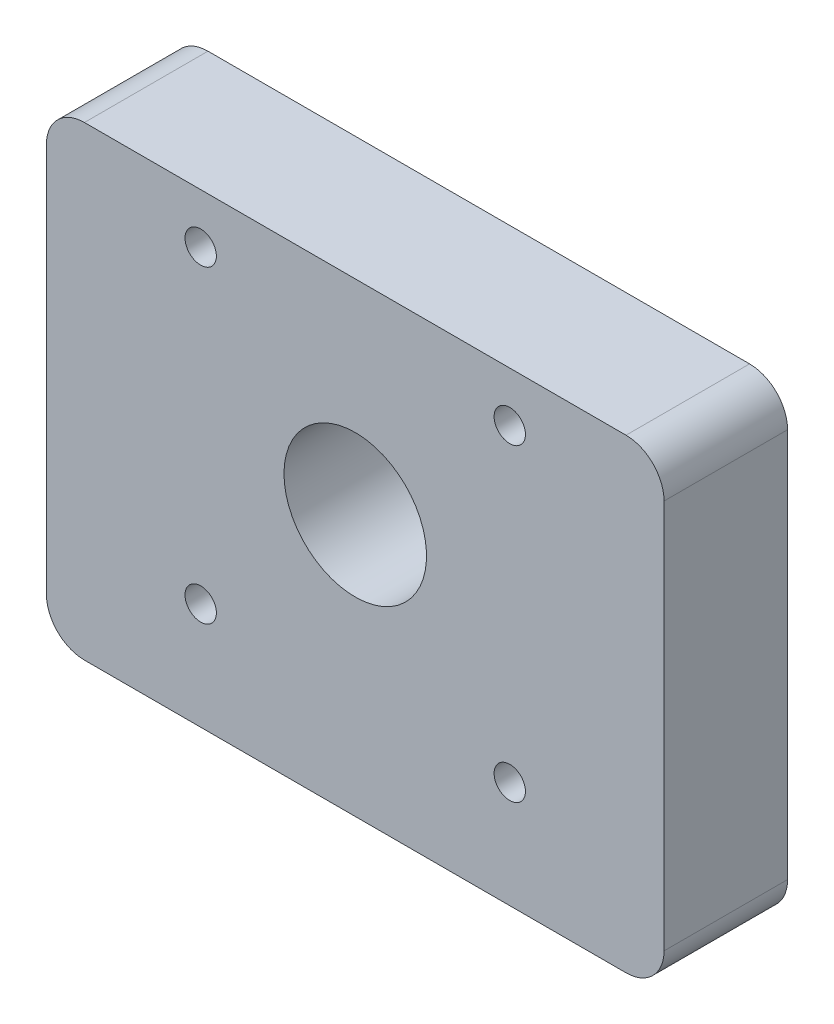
ISO-10303-21;
HEADER;
FILE_DESCRIPTION(('STEP AP214'),'2;1');
FILE_NAME('part.step','',(''),(''),'','','');
FILE_SCHEMA(('AUTOMOTIVE_DESIGN { 1 0 10303 214 1 1 1 1 }'));
ENDSEC;
DATA;
#1=APPLICATION_CONTEXT('core data for automotive mechanical design processes');
#2=APPLICATION_PROTOCOL_DEFINITION('international standard','automotive_design',2000,#1);
#3=PRODUCT_CONTEXT('',#1,'mechanical');
#4=PRODUCT('Part','Part','',(#3));
#5=PRODUCT_RELATED_PRODUCT_CATEGORY('part','',(#4));
#6=PRODUCT_DEFINITION_FORMATION('','',#4);
#7=PRODUCT_DEFINITION_CONTEXT('part definition',#1,'design');
#8=PRODUCT_DEFINITION('design','',#6,#7);
#9=PRODUCT_DEFINITION_SHAPE('','',#8);
#10=(LENGTH_UNIT() NAMED_UNIT(*) SI_UNIT(.MILLI.,.METRE.));
#11=(NAMED_UNIT(*) PLANE_ANGLE_UNIT() SI_UNIT($,.RADIAN.));
#12=(NAMED_UNIT(*) SI_UNIT($,.STERADIAN.) SOLID_ANGLE_UNIT());
#13=UNCERTAINTY_MEASURE_WITH_UNIT(LENGTH_MEASURE(1.E-05),#10,'distance_accuracy_value','');
#14=(GEOMETRIC_REPRESENTATION_CONTEXT(3) GLOBAL_UNCERTAINTY_ASSIGNED_CONTEXT((#13)) GLOBAL_UNIT_ASSIGNED_CONTEXT((#10,
#11,#12)) REPRESENTATION_CONTEXT('',''));
#15=CARTESIAN_POINT('',(0.,0.,0.));
#16=DIRECTION('',(0.,0.,1.));
#17=DIRECTION('',(1.,0.,0.));
#18=AXIS2_PLACEMENT_3D('',#15,#16,#17);
#19=CARTESIAN_POINT('',(32.5,-27.5,13.));
#20=DIRECTION('',(-1.,0.,0.));
#21=DIRECTION('',(0.,0.,1.));
#22=AXIS2_PLACEMENT_3D('',#19,#20,#21);
#23=PLANE('',#22);
#24=DIRECTION('',(0.,1.,0.));
#25=VECTOR('',#24,1.);
#26=CARTESIAN_POINT('',(32.5,-27.5,0.));
#27=LINE('',#26,#25);
#28=CARTESIAN_POINT('',(32.5,-23.5,0.));
#29=VERTEX_POINT('',#28);
#30=CARTESIAN_POINT('',(32.5,17.5,0.));
#31=VERTEX_POINT('',#30);
#32=EDGE_CURVE('E150',#29,#31,#27,.T.);
#33=ORIENTED_EDGE('',*,*,#32,.T.);
#34=DIRECTION('',(0.,0.,-1.));
#35=VECTOR('',#34,1.);
#36=CARTESIAN_POINT('',(32.5,17.5,13.));
#37=LINE('',#36,#35);
#38=CARTESIAN_POINT('',(32.5,17.5,13.));
#39=VERTEX_POINT('',#38);
#40=EDGE_CURVE('E199',#31,#39,#37,.F.);
#41=ORIENTED_EDGE('',*,*,#40,.T.);
#42=DIRECTION('',(0.,1.,0.));
#43=VECTOR('',#42,1.);
#44=CARTESIAN_POINT('',(32.5,-27.5,13.));
#45=LINE('',#44,#43);
#46=CARTESIAN_POINT('',(32.5,-23.5,13.));
#47=VERTEX_POINT('',#46);
#48=EDGE_CURVE('E151',#47,#39,#45,.T.);
#49=ORIENTED_EDGE('',*,*,#48,.F.);
#50=DIRECTION('',(0.,0.,-1.));
#51=VECTOR('',#50,1.);
#52=CARTESIAN_POINT('',(32.5,-23.5,13.));
#53=LINE('',#52,#51);
#54=EDGE_CURVE('E196',#47,#29,#53,.T.);
#55=ORIENTED_EDGE('',*,*,#54,.T.);
#56=EDGE_LOOP('',(#33,#41,#49,#55));
#57=FACE_BOUND('',#56,.T.);
#58=ADVANCED_FACE('F36',(#57),#23,.F.);
#59=CARTESIAN_POINT('',(-32.5,21.5,13.));
#60=DIRECTION('',(0.,-1.,0.));
#61=DIRECTION('',(0.,0.,-1.));
#62=AXIS2_PLACEMENT_3D('',#59,#60,#61);
#63=PLANE('',#62);
#64=DIRECTION('',(-1.,0.,0.));
#65=VECTOR('',#64,1.);
#66=CARTESIAN_POINT('',(-32.5,21.5,0.));
#67=LINE('',#66,#65);
#68=CARTESIAN_POINT('',(28.5,21.5,0.));
#69=VERTEX_POINT('',#68);
#70=CARTESIAN_POINT('',(-28.5,21.5,0.));
#71=VERTEX_POINT('',#70);
#72=EDGE_CURVE('E165',#69,#71,#67,.T.);
#73=ORIENTED_EDGE('',*,*,#72,.T.);
#74=DIRECTION('',(0.,0.,-1.));
#75=VECTOR('',#74,1.);
#76=CARTESIAN_POINT('',(-28.5,21.5,13.));
#77=LINE('',#76,#75);
#78=CARTESIAN_POINT('',(-28.5,21.5,13.));
#79=VERTEX_POINT('',#78);
#80=EDGE_CURVE('E187',#71,#79,#77,.F.);
#81=ORIENTED_EDGE('',*,*,#80,.T.);
#82=DIRECTION('',(-1.,0.,0.));
#83=VECTOR('',#82,1.);
#84=CARTESIAN_POINT('',(-32.5,21.5,13.));
#85=LINE('',#84,#83);
#86=CARTESIAN_POINT('',(28.5,21.5,13.));
#87=VERTEX_POINT('',#86);
#88=EDGE_CURVE('E154',#87,#79,#85,.T.);
#89=ORIENTED_EDGE('',*,*,#88,.F.);
#90=DIRECTION('',(0.,0.,-1.));
#91=VECTOR('',#90,1.);
#92=CARTESIAN_POINT('',(28.5,21.5,13.));
#93=LINE('',#92,#91);
#94=EDGE_CURVE('E184',#87,#69,#93,.T.);
#95=ORIENTED_EDGE('',*,*,#94,.T.);
#96=EDGE_LOOP('',(#73,#81,#89,#95));
#97=FACE_BOUND('',#96,.T.);
#98=ADVANCED_FACE('F224',(#97),#63,.F.);
#99=CARTESIAN_POINT('',(-32.5,-27.5,13.));
#100=DIRECTION('',(1.,0.,0.));
#101=DIRECTION('',(0.,0.,-1.));
#102=AXIS2_PLACEMENT_3D('',#99,#100,#101);
#103=PLANE('',#102);
#104=DIRECTION('',(0.,-1.,0.));
#105=VECTOR('',#104,1.);
#106=CARTESIAN_POINT('',(-32.5,-27.5,13.));
#107=LINE('',#106,#105);
#108=CARTESIAN_POINT('',(-32.5,17.5,13.));
#109=VERTEX_POINT('',#108);
#110=CARTESIAN_POINT('',(-32.5,-23.5,13.));
#111=VERTEX_POINT('',#110);
#112=EDGE_CURVE('E158',#109,#111,#107,.T.);
#113=ORIENTED_EDGE('',*,*,#112,.F.);
#114=DIRECTION('',(0.,0.,-1.));
#115=VECTOR('',#114,1.);
#116=CARTESIAN_POINT('',(-32.5,17.5,13.));
#117=LINE('',#116,#115);
#118=CARTESIAN_POINT('',(-32.5,17.5,0.));
#119=VERTEX_POINT('',#118);
#120=EDGE_CURVE('E173',#109,#119,#117,.T.);
#121=ORIENTED_EDGE('',*,*,#120,.T.);
#122=DIRECTION('',(0.,-1.,0.));
#123=VECTOR('',#122,1.);
#124=CARTESIAN_POINT('',(-32.5,-27.5,0.));
#125=LINE('',#124,#123);
#126=CARTESIAN_POINT('',(-32.5,-23.5,0.));
#127=VERTEX_POINT('',#126);
#128=EDGE_CURVE('E168',#119,#127,#125,.T.);
#129=ORIENTED_EDGE('',*,*,#128,.T.);
#130=DIRECTION('',(0.,0.,-1.));
#131=VECTOR('',#130,1.);
#132=CARTESIAN_POINT('',(-32.5,-23.5,13.));
#133=LINE('',#132,#131);
#134=EDGE_CURVE('E162',#127,#111,#133,.F.);
#135=ORIENTED_EDGE('',*,*,#134,.T.);
#136=EDGE_LOOP('',(#113,#121,#129,#135));
#137=FACE_BOUND('',#136,.T.);
#138=ADVANCED_FACE('F232',(#137),#103,.F.);
#139=CARTESIAN_POINT('',(-32.5,-27.5,13.));
#140=DIRECTION('',(0.,1.,0.));
#141=DIRECTION('',(0.,0.,1.));
#142=AXIS2_PLACEMENT_3D('',#139,#140,#141);
#143=PLANE('',#142);
#144=DIRECTION('',(1.,0.,0.));
#145=VECTOR('',#144,1.);
#146=CARTESIAN_POINT('',(-32.5,-27.5,0.));
#147=LINE('',#146,#145);
#148=CARTESIAN_POINT('',(-28.5,-27.5,0.));
#149=VERTEX_POINT('',#148);
#150=CARTESIAN_POINT('',(28.5,-27.5,0.));
#151=VERTEX_POINT('',#150);
#152=EDGE_CURVE('E155',#149,#151,#147,.T.);
#153=ORIENTED_EDGE('',*,*,#152,.T.);
#154=DIRECTION('',(0.,0.,-1.));
#155=VECTOR('',#154,1.);
#156=CARTESIAN_POINT('',(28.5,-27.5,13.));
#157=LINE('',#156,#155);
#158=CARTESIAN_POINT('',(28.5,-27.5,13.));
#159=VERTEX_POINT('',#158);
#160=EDGE_CURVE('E11',#151,#159,#157,.F.);
#161=ORIENTED_EDGE('',*,*,#160,.T.);
#162=DIRECTION('',(1.,0.,0.));
#163=VECTOR('',#162,1.);
#164=CARTESIAN_POINT('',(-32.5,-27.5,13.));
#165=LINE('',#164,#163);
#166=CARTESIAN_POINT('',(-28.5,-27.5,13.));
#167=VERTEX_POINT('',#166);
#168=EDGE_CURVE('E160',#167,#159,#165,.T.);
#169=ORIENTED_EDGE('',*,*,#168,.F.);
#170=DIRECTION('',(0.,0.,-1.));
#171=VECTOR('',#170,1.);
#172=CARTESIAN_POINT('',(-28.5,-27.5,13.));
#173=LINE('',#172,#171);
#174=EDGE_CURVE('E44',#167,#149,#173,.T.);
#175=ORIENTED_EDGE('',*,*,#174,.T.);
#176=EDGE_LOOP('',(#153,#161,#169,#175));
#177=FACE_BOUND('',#176,.T.);
#178=ADVANCED_FACE('F203',(#177),#143,.F.);
#179=CARTESIAN_POINT('',(32.5,21.5,13.));
#180=DIRECTION('',(0.,0.,-1.));
#181=DIRECTION('',(-1.,0.,0.));
#182=AXIS2_PLACEMENT_3D('',#179,#180,#181);
#183=PLANE('',#182);
#184=CARTESIAN_POINT('',(-16.2634559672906,16.2634559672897,13.));
#185=DIRECTION('',(0.,0.,1.));
#186=DIRECTION('',(1.,0.,0.));
#187=AXIS2_PLACEMENT_3D('',#184,#185,#186);
#188=CIRCLE('',#187,1.65);
#189=CARTESIAN_POINT('',(-14.6134559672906,16.2634559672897,13.));
#190=VERTEX_POINT('',#189);
#191=EDGE_CURVE('E122',#190,#190,#188,.T.);
#192=ORIENTED_EDGE('',*,*,#191,.F.);
#193=EDGE_LOOP('',(#192));
#194=FACE_BOUND('',#193,.T.);
#195=CARTESIAN_POINT('',(16.2634559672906,16.2634559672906,13.));
#196=DIRECTION('',(0.,0.,1.));
#197=DIRECTION('',(1.,0.,0.));
#198=AXIS2_PLACEMENT_3D('',#195,#196,#197);
#199=CIRCLE('',#198,1.65);
#200=CARTESIAN_POINT('',(17.9134559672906,16.2634559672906,13.));
#201=VERTEX_POINT('',#200);
#202=EDGE_CURVE('E121',#201,#201,#199,.T.);
#203=ORIENTED_EDGE('',*,*,#202,.F.);
#204=EDGE_LOOP('',(#203));
#205=FACE_BOUND('',#204,.T.);
#206=CARTESIAN_POINT('',(16.2634559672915,-16.2634559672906,13.));
#207=DIRECTION('',(0.,0.,1.));
#208=DIRECTION('',(1.,0.,0.));
#209=AXIS2_PLACEMENT_3D('',#206,#207,#208);
#210=CIRCLE('',#209,1.65);
#211=CARTESIAN_POINT('',(17.9134559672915,-16.2634559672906,13.));
#212=VERTEX_POINT('',#211);
#213=EDGE_CURVE('E132',#212,#212,#210,.T.);
#214=ORIENTED_EDGE('',*,*,#213,.F.);
#215=EDGE_LOOP('',(#214));
#216=FACE_BOUND('',#215,.T.);
#217=CARTESIAN_POINT('',(-16.2634559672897,-16.2634559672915,13.));
#218=DIRECTION('',(0.,0.,1.));
#219=DIRECTION('',(1.,0.,0.));
#220=AXIS2_PLACEMENT_3D('',#217,#218,#219);
#221=CIRCLE('',#220,1.65);
#222=CARTESIAN_POINT('',(-14.6134559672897,-16.2634559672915,13.));
#223=VERTEX_POINT('',#222);
#224=EDGE_CURVE('E138',#223,#223,#221,.T.);
#225=ORIENTED_EDGE('',*,*,#224,.F.);
#226=EDGE_LOOP('',(#225));
#227=FACE_BOUND('',#226,.T.);
#228=CARTESIAN_POINT('',(0.,0.,13.));
#229=DIRECTION('',(0.,0.,-1.));
#230=DIRECTION('',(-1.,0.,0.));
#231=AXIS2_PLACEMENT_3D('',#228,#229,#230);
#232=CIRCLE('',#231,7.5);
#233=CARTESIAN_POINT('',(-7.5,0.,13.));
#234=VERTEX_POINT('',#233);
#235=EDGE_CURVE('E147',#234,#234,#232,.T.);
#236=ORIENTED_EDGE('',*,*,#235,.T.);
#237=EDGE_LOOP('',(#236));
#238=FACE_BOUND('',#237,.T.);
#239=ORIENTED_EDGE('',*,*,#88,.T.);
#240=CARTESIAN_POINT('',(-28.5,17.5,13.));
#241=DIRECTION('',(0.,0.,-1.));
#242=DIRECTION('',(-1.,0.,0.));
#243=AXIS2_PLACEMENT_3D('',#240,#241,#242);
#244=CIRCLE('',#243,4.);
#245=EDGE_CURVE('E194',#79,#109,#244,.F.);
#246=ORIENTED_EDGE('',*,*,#245,.T.);
#247=ORIENTED_EDGE('',*,*,#112,.T.);
#248=CARTESIAN_POINT('',(-28.5,-23.5,13.));
#249=DIRECTION('',(0.,0.,-1.));
#250=DIRECTION('',(-1.,0.,0.));
#251=AXIS2_PLACEMENT_3D('',#248,#249,#250);
#252=CIRCLE('',#251,4.);
#253=EDGE_CURVE('E56',#111,#167,#252,.F.);
#254=ORIENTED_EDGE('',*,*,#253,.T.);
#255=ORIENTED_EDGE('',*,*,#168,.T.);
#256=CARTESIAN_POINT('',(28.5,-23.5,13.));
#257=DIRECTION('',(0.,0.,-1.));
#258=DIRECTION('',(-1.,0.,0.));
#259=AXIS2_PLACEMENT_3D('',#256,#257,#258);
#260=CIRCLE('',#259,4.);
#261=EDGE_CURVE('E190',#159,#47,#260,.F.);
#262=ORIENTED_EDGE('',*,*,#261,.T.);
#263=ORIENTED_EDGE('',*,*,#48,.T.);
#264=CARTESIAN_POINT('',(28.5,17.5,13.));
#265=DIRECTION('',(0.,0.,-1.));
#266=DIRECTION('',(-1.,0.,0.));
#267=AXIS2_PLACEMENT_3D('',#264,#265,#266);
#268=CIRCLE('',#267,4.);
#269=EDGE_CURVE('E192',#39,#87,#268,.F.);
#270=ORIENTED_EDGE('',*,*,#269,.T.);
#271=EDGE_LOOP('',(#239,#246,#247,#254,#255,#262,#263,#270));
#272=FACE_BOUND('',#271,.T.);
#273=ADVANCED_FACE('F217',(#194,#205,#216,#227,#238,#272),#183,.F.);
#274=CARTESIAN_POINT('',(32.5,21.5,0.));
#275=DIRECTION('',(0.,0.,-1.));
#276=DIRECTION('',(-1.,0.,0.));
#277=AXIS2_PLACEMENT_3D('',#274,#275,#276);
#278=PLANE('',#277);
#279=CARTESIAN_POINT('',(0.,0.,0.));
#280=DIRECTION('',(0.,0.,-1.));
#281=DIRECTION('',(-1.,0.,0.));
#282=AXIS2_PLACEMENT_3D('',#279,#280,#281);
#283=CIRCLE('',#282,7.5);
#284=CARTESIAN_POINT('',(-7.5,0.,0.));
#285=VERTEX_POINT('',#284);
#286=EDGE_CURVE('E144',#285,#285,#283,.T.);
#287=ORIENTED_EDGE('',*,*,#286,.F.);
#288=EDGE_LOOP('',(#287));
#289=FACE_BOUND('',#288,.T.);
#290=ORIENTED_EDGE('',*,*,#128,.F.);
#291=CARTESIAN_POINT('',(-28.5,17.5,0.));
#292=DIRECTION('',(0.,0.,-1.));
#293=DIRECTION('',(-1.,0.,0.));
#294=AXIS2_PLACEMENT_3D('',#291,#292,#293);
#295=CIRCLE('',#294,4.);
#296=EDGE_CURVE('E182',#119,#71,#295,.T.);
#297=ORIENTED_EDGE('',*,*,#296,.T.);
#298=ORIENTED_EDGE('',*,*,#72,.F.);
#299=CARTESIAN_POINT('',(28.5,17.5,0.));
#300=DIRECTION('',(0.,0.,-1.));
#301=DIRECTION('',(-1.,0.,0.));
#302=AXIS2_PLACEMENT_3D('',#299,#300,#301);
#303=CIRCLE('',#302,4.);
#304=EDGE_CURVE('E180',#69,#31,#303,.T.);
#305=ORIENTED_EDGE('',*,*,#304,.T.);
#306=ORIENTED_EDGE('',*,*,#32,.F.);
#307=CARTESIAN_POINT('',(28.5,-23.5,0.));
#308=DIRECTION('',(0.,0.,-1.));
#309=DIRECTION('',(-1.,0.,0.));
#310=AXIS2_PLACEMENT_3D('',#307,#308,#309);
#311=CIRCLE('',#310,4.);
#312=EDGE_CURVE('E178',#29,#151,#311,.T.);
#313=ORIENTED_EDGE('',*,*,#312,.T.);
#314=ORIENTED_EDGE('',*,*,#152,.F.);
#315=CARTESIAN_POINT('',(-28.5,-23.5,0.));
#316=DIRECTION('',(0.,0.,-1.));
#317=DIRECTION('',(-1.,0.,0.));
#318=AXIS2_PLACEMENT_3D('',#315,#316,#317);
#319=CIRCLE('',#318,4.);
#320=EDGE_CURVE('E176',#149,#127,#319,.T.);
#321=ORIENTED_EDGE('',*,*,#320,.T.);
#322=EDGE_LOOP('',(#290,#297,#298,#305,#306,#313,#314,#321));
#323=FACE_BOUND('',#322,.T.);
#324=ADVANCED_FACE('F207',(#289,#323),#278,.T.);
#325=CARTESIAN_POINT('',(0.,0.,37.5));
#326=DIRECTION('',(0.,0.,-1.));
#327=DIRECTION('',(-1.,0.,0.));
#328=AXIS2_PLACEMENT_3D('',#325,#326,#327);
#329=CYLINDRICAL_SURFACE('',#328,7.5);
#330=ORIENTED_EDGE('',*,*,#286,.T.);
#331=EDGE_LOOP('',(#330));
#332=FACE_BOUND('',#331,.T.);
#333=ORIENTED_EDGE('',*,*,#235,.F.);
#334=EDGE_LOOP('',(#333));
#335=FACE_BOUND('',#334,.T.);
#336=ADVANCED_FACE('F253',(#332,#335),#329,.F.);
#337=CARTESIAN_POINT('',(-28.5,17.5,13.));
#338=DIRECTION('',(0.,0.,-1.));
#339=DIRECTION('',(-1.,0.,0.));
#340=AXIS2_PLACEMENT_3D('',#337,#338,#339);
#341=CYLINDRICAL_SURFACE('',#340,4.);
#342=ORIENTED_EDGE('',*,*,#245,.F.);
#343=ORIENTED_EDGE('',*,*,#80,.F.);
#344=ORIENTED_EDGE('',*,*,#296,.F.);
#345=ORIENTED_EDGE('',*,*,#120,.F.);
#346=EDGE_LOOP('',(#342,#343,#344,#345));
#347=FACE_BOUND('',#346,.T.);
#348=ADVANCED_FACE('F229',(#347),#341,.T.);
#349=CARTESIAN_POINT('',(28.5,17.5,13.));
#350=DIRECTION('',(0.,0.,-1.));
#351=DIRECTION('',(-1.,0.,0.));
#352=AXIS2_PLACEMENT_3D('',#349,#350,#351);
#353=CYLINDRICAL_SURFACE('',#352,4.);
#354=ORIENTED_EDGE('',*,*,#269,.F.);
#355=ORIENTED_EDGE('',*,*,#40,.F.);
#356=ORIENTED_EDGE('',*,*,#304,.F.);
#357=ORIENTED_EDGE('',*,*,#94,.F.);
#358=EDGE_LOOP('',(#354,#355,#356,#357));
#359=FACE_BOUND('',#358,.T.);
#360=ADVANCED_FACE('F221',(#359),#353,.T.);
#361=CARTESIAN_POINT('',(28.5,-23.5,13.));
#362=DIRECTION('',(0.,0.,-1.));
#363=DIRECTION('',(-1.,0.,0.));
#364=AXIS2_PLACEMENT_3D('',#361,#362,#363);
#365=CYLINDRICAL_SURFACE('',#364,4.);
#366=ORIENTED_EDGE('',*,*,#261,.F.);
#367=ORIENTED_EDGE('',*,*,#160,.F.);
#368=ORIENTED_EDGE('',*,*,#312,.F.);
#369=ORIENTED_EDGE('',*,*,#54,.F.);
#370=EDGE_LOOP('',(#366,#367,#368,#369));
#371=FACE_BOUND('',#370,.T.);
#372=ADVANCED_FACE('F212',(#371),#365,.T.);
#373=CARTESIAN_POINT('',(-28.5,-23.5,13.));
#374=DIRECTION('',(0.,0.,-1.));
#375=DIRECTION('',(-1.,0.,0.));
#376=AXIS2_PLACEMENT_3D('',#373,#374,#375);
#377=CYLINDRICAL_SURFACE('',#376,4.);
#378=ORIENTED_EDGE('',*,*,#253,.F.);
#379=ORIENTED_EDGE('',*,*,#134,.F.);
#380=ORIENTED_EDGE('',*,*,#320,.F.);
#381=ORIENTED_EDGE('',*,*,#174,.F.);
#382=EDGE_LOOP('',(#378,#379,#380,#381));
#383=FACE_BOUND('',#382,.T.);
#384=ADVANCED_FACE('F38',(#383),#377,.T.);
#385=CARTESIAN_POINT('',(-16.2634559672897,-16.2634559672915,2.9));
#386=DIRECTION('',(0.,0.,1.));
#387=DIRECTION('',(1.,0.,0.));
#388=AXIS2_PLACEMENT_3D('',#385,#386,#387);
#389=CONICAL_SURFACE('',#388,1.65,1.02974425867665);
#390=CARTESIAN_POINT('',(-16.2634559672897,-16.2634559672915,1.90857997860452));
#391=VERTEX_POINT('',#390);
#392=VERTEX_LOOP('',#391);
#393=FACE_BOUND('',#392,.T.);
#394=CARTESIAN_POINT('',(-16.2634559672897,-16.2634559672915,2.9));
#395=DIRECTION('',(0.,0.,1.));
#396=DIRECTION('',(1.,0.,0.));
#397=AXIS2_PLACEMENT_3D('',#394,#395,#396);
#398=CIRCLE('',#397,1.65);
#399=CARTESIAN_POINT('',(-14.6134559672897,-16.2634559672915,2.9));
#400=VERTEX_POINT('',#399);
#401=EDGE_CURVE('E141',#400,#400,#398,.T.);
#402=ORIENTED_EDGE('',*,*,#401,.T.);
#403=EDGE_LOOP('',(#402));
#404=FACE_BOUND('',#403,.T.);
#405=ADVANCED_FACE('F235',(#393,#404),#389,.F.);
#406=CARTESIAN_POINT('',(-16.2634559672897,-16.2634559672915,13.));
#407=DIRECTION('',(0.,0.,1.));
#408=DIRECTION('',(1.,0.,0.));
#409=AXIS2_PLACEMENT_3D('',#406,#407,#408);
#410=CYLINDRICAL_SURFACE('',#409,1.65);
#411=ORIENTED_EDGE('',*,*,#401,.F.);
#412=EDGE_LOOP('',(#411));
#413=FACE_BOUND('',#412,.T.);
#414=ORIENTED_EDGE('',*,*,#224,.T.);
#415=EDGE_LOOP('',(#414));
#416=FACE_BOUND('',#415,.T.);
#417=ADVANCED_FACE('F240',(#413,#416),#410,.F.);
#418=CARTESIAN_POINT('',(16.2634559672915,-16.2634559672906,2.9));
#419=DIRECTION('',(0.,0.,1.));
#420=DIRECTION('',(1.,0.,0.));
#421=AXIS2_PLACEMENT_3D('',#418,#419,#420);
#422=CONICAL_SURFACE('',#421,1.65,1.02974425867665);
#423=CARTESIAN_POINT('',(16.2634559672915,-16.2634559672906,1.90857997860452));
#424=VERTEX_POINT('',#423);
#425=VERTEX_LOOP('',#424);
#426=FACE_BOUND('',#425,.T.);
#427=CARTESIAN_POINT('',(16.2634559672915,-16.2634559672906,2.9));
#428=DIRECTION('',(0.,0.,1.));
#429=DIRECTION('',(1.,0.,0.));
#430=AXIS2_PLACEMENT_3D('',#427,#428,#429);
#431=CIRCLE('',#430,1.65);
#432=CARTESIAN_POINT('',(17.9134559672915,-16.2634559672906,2.9));
#433=VERTEX_POINT('',#432);
#434=EDGE_CURVE('E135',#433,#433,#431,.T.);
#435=ORIENTED_EDGE('',*,*,#434,.T.);
#436=EDGE_LOOP('',(#435));
#437=FACE_BOUND('',#436,.T.);
#438=ADVANCED_FACE('F297',(#426,#437),#422,.F.);
#439=CARTESIAN_POINT('',(16.2634559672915,-16.2634559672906,13.));
#440=DIRECTION('',(0.,0.,1.));
#441=DIRECTION('',(1.,0.,0.));
#442=AXIS2_PLACEMENT_3D('',#439,#440,#441);
#443=CYLINDRICAL_SURFACE('',#442,1.65);
#444=ORIENTED_EDGE('',*,*,#434,.F.);
#445=EDGE_LOOP('',(#444));
#446=FACE_BOUND('',#445,.T.);
#447=ORIENTED_EDGE('',*,*,#213,.T.);
#448=EDGE_LOOP('',(#447));
#449=FACE_BOUND('',#448,.T.);
#450=ADVANCED_FACE('F309',(#446,#449),#443,.F.);
#451=CARTESIAN_POINT('',(16.2634559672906,16.2634559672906,2.9));
#452=DIRECTION('',(0.,0.,1.));
#453=DIRECTION('',(1.,0.,0.));
#454=AXIS2_PLACEMENT_3D('',#451,#452,#453);
#455=CONICAL_SURFACE('',#454,1.65,1.02974425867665);
#456=CARTESIAN_POINT('',(16.2634559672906,16.2634559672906,1.90857997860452));
#457=VERTEX_POINT('',#456);
#458=VERTEX_LOOP('',#457);
#459=FACE_BOUND('',#458,.T.);
#460=CARTESIAN_POINT('',(16.2634559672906,16.2634559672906,2.9));
#461=DIRECTION('',(0.,0.,1.));
#462=DIRECTION('',(1.,0.,0.));
#463=AXIS2_PLACEMENT_3D('',#460,#461,#462);
#464=CIRCLE('',#463,1.65);
#465=CARTESIAN_POINT('',(17.9134559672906,16.2634559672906,2.9));
#466=VERTEX_POINT('',#465);
#467=EDGE_CURVE('E125',#466,#466,#464,.T.);
#468=ORIENTED_EDGE('',*,*,#467,.T.);
#469=EDGE_LOOP('',(#468));
#470=FACE_BOUND('',#469,.T.);
#471=ADVANCED_FACE('F319',(#459,#470),#455,.F.);
#472=CARTESIAN_POINT('',(16.2634559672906,16.2634559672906,13.));
#473=DIRECTION('',(0.,0.,1.));
#474=DIRECTION('',(1.,0.,0.));
#475=AXIS2_PLACEMENT_3D('',#472,#473,#474);
#476=CYLINDRICAL_SURFACE('',#475,1.65);
#477=ORIENTED_EDGE('',*,*,#467,.F.);
#478=EDGE_LOOP('',(#477));
#479=FACE_BOUND('',#478,.T.);
#480=ORIENTED_EDGE('',*,*,#202,.T.);
#481=EDGE_LOOP('',(#480));
#482=FACE_BOUND('',#481,.T.);
#483=ADVANCED_FACE('F115',(#479,#482),#476,.F.);
#484=CARTESIAN_POINT('',(-16.2634559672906,16.2634559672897,2.9));
#485=DIRECTION('',(0.,0.,1.));
#486=DIRECTION('',(1.,0.,0.));
#487=AXIS2_PLACEMENT_3D('',#484,#485,#486);
#488=CONICAL_SURFACE('',#487,1.65,1.02974425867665);
#489=CARTESIAN_POINT('',(-16.2634559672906,16.2634559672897,1.90857997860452));
#490=VERTEX_POINT('',#489);
#491=VERTEX_LOOP('',#490);
#492=FACE_BOUND('',#491,.T.);
#493=CARTESIAN_POINT('',(-16.2634559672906,16.2634559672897,2.9));
#494=DIRECTION('',(0.,0.,1.));
#495=DIRECTION('',(1.,0.,0.));
#496=AXIS2_PLACEMENT_3D('',#493,#494,#495);
#497=CIRCLE('',#496,1.65);
#498=CARTESIAN_POINT('',(-14.6134559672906,16.2634559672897,2.9));
#499=VERTEX_POINT('',#498);
#500=EDGE_CURVE('E119',#499,#499,#497,.T.);
#501=ORIENTED_EDGE('',*,*,#500,.T.);
#502=EDGE_LOOP('',(#501));
#503=FACE_BOUND('',#502,.T.);
#504=ADVANCED_FACE('F111',(#492,#503),#488,.F.);
#505=CARTESIAN_POINT('',(-16.2634559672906,16.2634559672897,13.));
#506=DIRECTION('',(0.,0.,1.));
#507=DIRECTION('',(1.,0.,0.));
#508=AXIS2_PLACEMENT_3D('',#505,#506,#507);
#509=CYLINDRICAL_SURFACE('',#508,1.65);
#510=ORIENTED_EDGE('',*,*,#500,.F.);
#511=EDGE_LOOP('',(#510));
#512=FACE_BOUND('',#511,.T.);
#513=ORIENTED_EDGE('',*,*,#191,.T.);
#514=EDGE_LOOP('',(#513));
#515=FACE_BOUND('',#514,.T.);
#516=ADVANCED_FACE('F114',(#512,#515),#509,.F.);
#517=CLOSED_SHELL('',(#58,#98,#138,#178,#273,#324,#336,#348,#360,#372,#384,#405,#417,#438,#450,
#471,#483,#504,#516));
#518=MANIFOLD_SOLID_BREP('B2',#517);
#519=ADVANCED_BREP_SHAPE_REPRESENTATION('',(#18,#518),#14);
#520=SHAPE_DEFINITION_REPRESENTATION(#9,#519);
ENDSEC;
END-ISO-10303-21;
